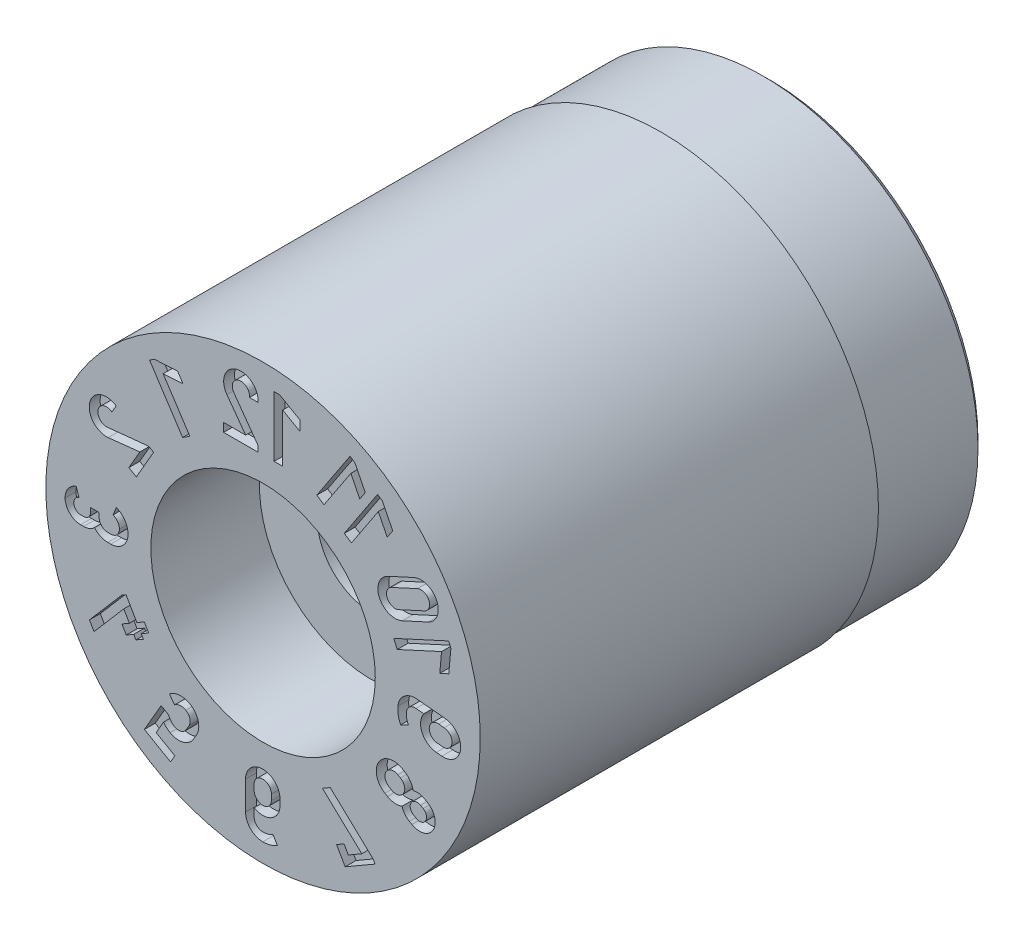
from build123d import *

# Parameters (mm, degrees)
SKETCH4_W          = 3
SKETCH4_H          = 1
CUT_EXTRUDE1_DEPTH = 0.3


with BuildPart() as part:
    # Sketch1 → Revolve1 (revolve)
    with BuildSketch(Plane(origin=(0, 0, 0), x_dir=(0, 0, -1), z_dir=(1, 0, 0)), mode=Mode.PRIVATE) as revolve1_sk:
        Polygon((0, 6), (0, 3.1), (3, 3.1), (3, 1.5), (14, 1.5), (14, 5.75), (13.75, 6), align=None)
    revolve(revolve1_sk.sketch.rotate(Axis((0, 0, 3.797909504), (0, 0, -1)), 90), axis=Axis((0, 0, 3.797909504), (0, 0, -1)))

    # Sketch4 → Cut-Revolve1 (revolve, cut)
    with BuildSketch(Plane(origin=(0, 0, 0), x_dir=(0, 0, -1), z_dir=(1, 0, 0)), mode=Mode.PRIVATE) as cut_revolve1_sk:
        with Locations((12.5, 6.435)):
            Rectangle(SKETCH4_W, SKETCH4_H)
    revolve(cut_revolve1_sk.sketch.rotate(Axis((0, 0, 0), (0, 0, -1)), 90), axis=Axis((0, 0, 0), (0, 0, -1)), mode=Mode.SUBTRACT)

    # Sketch2 → Cut-Extrude1 (cut)
    # profile 1 of 15: a face of its own
    with BuildSketch(Plane.XY):
        Polygon((3.16295357, 4.414065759), (3.293773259, 4.327602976), (3.582265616, 3.752443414), (3.430781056, 3.523244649), (3.184320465, 4.014418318), (2.442233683, 2.891628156), (2.243527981, 3.022958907), align=None)
    # profile 2 of 15: a face of its own
    with BuildSketch(Plane.XY):
        Polygon((2.404390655, 4.949103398), (2.535210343, 4.862640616), (2.823702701, 4.287481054), (2.672218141, 4.058282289), (2.42575755, 4.549455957), (1.683670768, 3.426665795), (1.484965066, 3.557996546), align=None)
    # profile 3 of 15: a face of its own
    with BuildSketch(Plane.XY):
        with BuildLine():
            Line((5.027552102, -0.010760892), (4.24483274, 0.062142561))
            ThreePointArc((4.24483274, 0.062142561), (3.896471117, -0.045506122), (3.72618414, -0.367913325))
            ThreePointArc((3.72618414, -0.367913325), (3.735104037, -0.579819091), (3.800392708, -0.78161356))
            Line((3.800392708, -0.78161356), (4.015477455, -0.678220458))
            ThreePointArc((4.015477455, -0.678220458), (3.965083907, -0.529227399), (3.965768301, -0.371944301))
            ThreePointArc((3.965768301, -0.371944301), (4.055617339, -0.223129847), (4.222660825, -0.175014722))
            Line((4.222660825, -0.175014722), (4.440365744, -0.195349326))
            ThreePointArc((4.440365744, -0.195349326), (4.395074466, -0.670356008), (4.784803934, -0.945662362))
            Line((4.784803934, -0.945662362), (4.93869892, -0.959486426))
            ThreePointArc((4.93869892, -0.959486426), (5.457488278, -0.52955025), (5.027552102, -0.010760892))
        make_face()
        with BuildLine():
            Line((5.005410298, -0.248047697), (4.85127017, -0.23366451))
            ThreePointArc((4.85127017, -0.23366451), (4.591949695, -0.448727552), (4.807021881, -0.708040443))
            Line((4.807021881, -0.708040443), (4.961128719, -0.722420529))
            ThreePointArc((4.961128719, -0.722420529), (5.220455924, -0.507374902), (5.005410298, -0.248047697))
        make_face(mode=Mode.SUBTRACT)
    # profile 4 of 15: a face of its own
    with BuildSketch(Plane.XY):
        Polygon((1.641483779, -3.377447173), (1.856826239, -3.253119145), (3.036945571, -4.365219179), (3.094107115, -4.464225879), (2.268897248, -4.940661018), (2.030679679, -4.528056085), (2.237011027, -4.408930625), (2.356103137, -4.61520421), (2.727407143, -4.400831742), align=None)
    # profile 5 of 15: a face of its own
    with BuildSketch(Plane.XY):
        with BuildLine():
            Line((3.91504143, -1.847474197), (3.842899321, -1.805745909))
            ThreePointArc((3.842899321, -1.805745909), (3.191746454, -1.979942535), (3.366464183, -2.630955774))
            Line((3.366464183, -2.630955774), (3.438615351, -2.672612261))
            ThreePointArc((3.438615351, -2.672612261), (3.635967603, -2.734703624), (3.841030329, -2.707271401))
            ThreePointArc((3.841030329, -2.707271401), (3.915178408, -2.855720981), (4.040081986, -2.964965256))
            Line((4.040081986, -2.964965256), (4.112305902, -3.00659461))
            ThreePointArc((4.112305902, -3.00659461), (4.697878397, -2.849657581), (4.540941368, -2.264085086))
            Line((4.540941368, -2.264085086), (4.468893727, -2.222180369))
            ThreePointArc((4.468893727, -2.222180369), (4.311912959, -2.168325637), (4.146271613, -2.178632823))
            ThreePointArc((4.146271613, -2.178632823), (4.067484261, -1.987338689), (3.91504143, -1.847474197))
        make_face()
        with BuildLine():
            Line((4.159164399, -2.758686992), (4.231387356, -2.800307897))
            ThreePointArc((4.231387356, -2.800307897), (4.49169811, -2.73055784), (4.421948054, -2.470247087))
            Line((4.421948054, -2.470247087), (4.349791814, -2.428510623))
            ThreePointArc((4.349791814, -2.428510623), (4.089125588, -2.498132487), (4.159164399, -2.758686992))
        make_face(mode=Mode.SUBTRACT)
        with BuildLine():
            Line((3.485517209, -2.424670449), (3.557775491, -2.46638881))
            ThreePointArc((3.557775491, -2.46638881), (3.883131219, -2.379170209), (3.795912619, -2.053814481))
            Line((3.795912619, -2.053814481), (3.723768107, -2.012007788))
            ThreePointArc((3.723768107, -2.012007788), (3.398398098, -2.099263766), (3.485517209, -2.424670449))
        make_face(mode=Mode.SUBTRACT)
    # profile 6 of 15: a face of its own
    with BuildSketch(Plane.XY):
        Polygon((5.124038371, 1.889507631), (5.189487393, 1.747008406), (5.130819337, 1.106231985), (4.881157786, 0.991563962), (4.93117882, 1.538822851), (3.70814634, 0.977091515), (3.60873398, 1.193537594), align=None)
    # profile 7 of 15: a face of its own
    with BuildSketch(Plane.XY):
        with BuildLine():
            Line((4.164363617, 2.927141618), (3.450006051, 2.599041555))
            ThreePointArc((3.450006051, 2.599041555), (3.215836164, 1.967141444), (3.847749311, 1.733006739))
            Line((3.847749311, 1.733006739), (4.562124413, 2.061114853))
            ThreePointArc((4.562124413, 2.061114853), (4.796257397, 2.693008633), (4.164363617, 2.927141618))
        make_face()
        with BuildLine():
            Line((3.748309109, 1.949513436), (4.462684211, 2.27762155))
            ThreePointArc((4.462684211, 2.27762155), (4.5797507, 2.593568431), (4.263803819, 2.71063492))
            Line((4.263803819, 2.71063492), (3.549413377, 2.38251976))
            ThreePointArc((3.549413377, 2.38251976), (3.432350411, 2.066565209), (3.748309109, 1.949513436))
        make_face(mode=Mode.SUBTRACT)
    # profile 8 of 15: a face of its own
    with BuildSketch(Plane.XY):
        Polygon((0.304944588, 5.444170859), (0.461755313, 5.444170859), (1.019563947, 5.123412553), (1.019563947, 4.84867696), (0.543128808, 5.122545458), (0.543128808, 3.776681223), (0.304944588, 3.776681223), align=None)
    # profile 9 of 15: a face of its own
    with BuildSketch(Plane.XY):
        with BuildLine():
            Line((-1.087798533, 3.773028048), (-0.134928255, 3.773028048))
            Line((-0.134928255, 3.773028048), (-0.134928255, 3.930572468))
            Line((-0.134928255, 3.930572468), (-0.804792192, 4.860564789))
            ThreePointArc((-0.804792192, 4.860564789), (-0.667340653, 5.23147438), (-0.375847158, 4.964082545))
            Line((-0.375847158, 4.964082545), (-0.136251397, 4.96407643))
            ThreePointArc((-0.136251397, 4.96407643), (-0.740848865, 5.458332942), (-0.998402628, 4.721112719))
            Line((-0.998402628, 4.721112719), (-0.480298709, 4.011278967))
            Line((-0.480298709, 4.011278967), (-1.087798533, 4.011278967))
            Line((-1.087798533, 4.011278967), (-1.087798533, 3.773028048))
        make_face()
    # profile 10 of 15: a face of its own
    with BuildSketch(Plane.XY):
        Polygon((-3.134945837, 4.478904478), (-3.003740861, 4.56478147), (-2.361354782, 4.601882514), (-2.210896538, 4.372008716), (-2.759517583, 4.340238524), (-2.022458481, 3.214141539), (-2.221749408, 3.083700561), align=None)
    # profile 11 of 15: a face of its own
    with BuildSketch(Plane.XY):
        with BuildLine():
            Line((0.468815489, -4.218880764), (0.469349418, -4.373394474))
            ThreePointArc((0.469349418, -4.373394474), (0.231443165, -4.787016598), (-0.245716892, -4.786053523))
            Line((-0.245716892, -4.786053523), (-0.245736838, -5.00470605))
            ThreePointArc((-0.245736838, -5.00470605), (-0.182310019, -5.166556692), (-0.025791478, -5.242190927))
            ThreePointArc((-0.025791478, -5.242190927), (0.130862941, -5.228261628), (0.274519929, -5.164251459))
            Line((0.274519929, -5.164251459), (0.397477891, -5.368817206))
            ThreePointArc((0.397477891, -5.368817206), (0.202622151, -5.45257196), (-0.007538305, -5.481141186))
            ThreePointArc((-0.007538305, -5.481141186), (-0.344372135, -5.341545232), (-0.483921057, -5.004691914))
            Line((-0.483921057, -5.004691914), (-0.484054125, -4.218555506))
            ThreePointArc((-0.484054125, -4.218555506), (-0.007456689, -3.742283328), (0.468815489, -4.218880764))
        make_face()
        with BuildLine():
            Line((-0.245736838, -4.218584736), (-0.245736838, -4.373394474))
            ThreePointArc((-0.245736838, -4.373394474), (-0.00751087, -4.611612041), (0.230698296, -4.373377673))
            Line((0.230698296, -4.373377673), (0.2306983, -4.218601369))
            ThreePointArc((0.2306983, -4.218601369), (-0.007510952, -3.980375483), (-0.245736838, -4.218584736))
        make_face(mode=Mode.SUBTRACT)
    # profile 12 of 15: a face of its own
    with BuildSketch(Plane.XY):
        with BuildLine():
            Line((-2.748721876, -3.988549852), (-2.952222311, -4.341022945))
            Line((-2.952222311, -4.341022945), (-2.436453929, -4.638801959))
            Line((-2.436453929, -4.638801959), (-2.555585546, -4.845143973))
            Line((-2.555585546, -4.845143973), (-3.277629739, -4.428271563))
            Line((-3.277629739, -4.428271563), (-2.815268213, -3.627437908))
            Line((-2.815268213, -3.627437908), (-2.608994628, -3.746530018))
            ThreePointArc((-2.608994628, -3.746530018), (-2.546824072, -3.860296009), (-2.448180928, -3.944423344))
            ThreePointArc((-2.448180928, -3.944423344), (-2.267428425, -3.968234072), (-2.122826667, -3.857199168))
            Line((-2.122826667, -3.857199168), (-2.045353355, -3.72314496))
            ThreePointArc((-2.045353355, -3.72314496), (-2.021521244, -3.542370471), (-2.132569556, -3.397748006))
            ThreePointArc((-2.132569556, -3.397748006), (-2.289766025, -3.36184838), (-2.439953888, -3.420526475))
            Line((-2.439953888, -3.420526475), (-2.588262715, -3.233852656))
            ThreePointArc((-2.588262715, -3.233852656), (-2.307408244, -3.124039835), (-2.013468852, -3.191402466))
            ThreePointArc((-2.013468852, -3.191402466), (-1.791611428, -3.480739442), (-1.839081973, -3.842240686))
            Line((-1.839081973, -3.842240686), (-1.91663653, -3.976168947))
            ThreePointArc((-1.91663653, -3.976168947), (-2.20592043, -4.197895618), (-2.567330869, -4.150668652))
            ThreePointArc((-2.567330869, -4.150668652), (-2.666465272, -4.079051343), (-2.748721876, -3.988549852))
        make_face()
    # profile 13 of 15: a face of its own
    with BuildSketch(Plane.XY):
        with BuildLine():
            Line((-4.205612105, -0.220795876), (-4.288988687, -0.220795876))
            ThreePointArc((-4.288988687, -0.220795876), (-4.457390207, -0.151041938), (-4.527144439, 0.01735946))
            Line((-4.527144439, 0.01735946), (-4.527144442, 0.136447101))
            Line((-4.527144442, 0.136447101), (-4.765395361, 0.136447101))
            Line((-4.765395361, 0.136447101), (-4.765395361, 0.017388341))
            ThreePointArc((-4.765395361, 0.017388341), (-4.821209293, -0.117358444), (-4.955956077, -0.173172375))
            Line((-4.955956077, -0.173172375), (-5.039321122, -0.17317236))
            ThreePointArc((-5.039321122, -0.17317236), (-5.174020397, -0.117311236), (-5.229891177, 0.017384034))
            ThreePointArc((-5.229891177, 0.017384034), (-5.189740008, 0.142412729), (-5.08415168, 0.220485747))
            Line((-5.08415168, 0.220485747), (-5.160390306, 0.446199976))
            ThreePointArc((-5.160390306, 0.446199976), (-5.383195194, 0.281289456), (-5.468113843, 0.017421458))
            ThreePointArc((-5.468113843, 0.017421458), (-5.342545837, -0.285835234), (-5.039297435, -0.411423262))
            Line((-5.039297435, -0.411423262), (-4.955956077, -0.411423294))
            ThreePointArc((-4.955956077, -0.411423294), (-4.793205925, -0.379321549), (-4.654835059, -0.287824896))
            ThreePointArc((-4.654835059, -0.287824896), (-4.490959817, -0.414146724), (-4.288978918, -0.459046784))
            Line((-4.288978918, -0.459046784), (-4.205571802, -0.459046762))
            ThreePointArc((-4.205571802, -0.459046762), (-3.868714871, -0.319502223), (-3.729217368, 0.017374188))
            ThreePointArc((-3.729217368, 0.017374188), (-3.81797587, 0.305510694), (-4.053429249, 0.493825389))
            Line((-4.053429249, 0.493825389), (-4.140833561, 0.272290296))
            ThreePointArc((-4.140833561, 0.272290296), (-4.014871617, 0.171557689), (-3.967401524, 0.017414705))
            ThreePointArc((-3.967401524, 0.017414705), (-4.037171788, -0.151025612), (-4.205612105, -0.220795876))
        make_face()
    # profile 14 of 15: a face of its own
    with BuildSketch(Plane.XY):
        Polygon((-4.795273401, -2.566022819), (-4.669111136, -2.784542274), (-3.846063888, -1.827992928), (-3.691754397, -2.095264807), (-3.898027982, -2.214356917), (-3.778935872, -2.420630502), (-3.572662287, -2.301538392), (-3.513099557, -2.404704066), (-3.306825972, -2.285611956), (-3.366388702, -2.182446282), (-3.160057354, -2.063320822), (-3.279149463, -1.857047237), (-3.485480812, -1.976172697), (-3.783261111, -1.460402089), (-3.903871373, -1.530036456), align=None)
    # profile 15 of 15: a face of its own
    with BuildSketch(Plane.XY):
        with BuildLine():
            Line((-3.70686055, 1.620681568), (-3.500529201, 1.501556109))
            Line((-3.500529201, 1.501556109), (-3.024093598, 2.32676678))
            Line((-3.024093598, 2.32676678), (-3.160528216, 2.405537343))
            Line((-3.160528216, 2.405537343), (-4.300857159, 2.290414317))
            ThreePointArc((-4.300857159, 2.290414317), (-4.553336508, 2.594891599), (-4.176039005, 2.713630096))
            Line((-4.176039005, 2.713630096), (-4.056241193, 2.921137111))
            ThreePointArc((-4.056241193, 2.921137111), (-4.786565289, 2.644666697), (-4.276896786, 2.053018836))
            Line((-4.276896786, 2.053018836), (-3.403110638, 2.146791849))
            Line((-3.403110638, 2.146791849), (-3.70686055, 1.620681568))
        make_face()
    extrude(amount=-CUT_EXTRUDE1_DEPTH, mode=Mode.SUBTRACT)


solid = part.part
